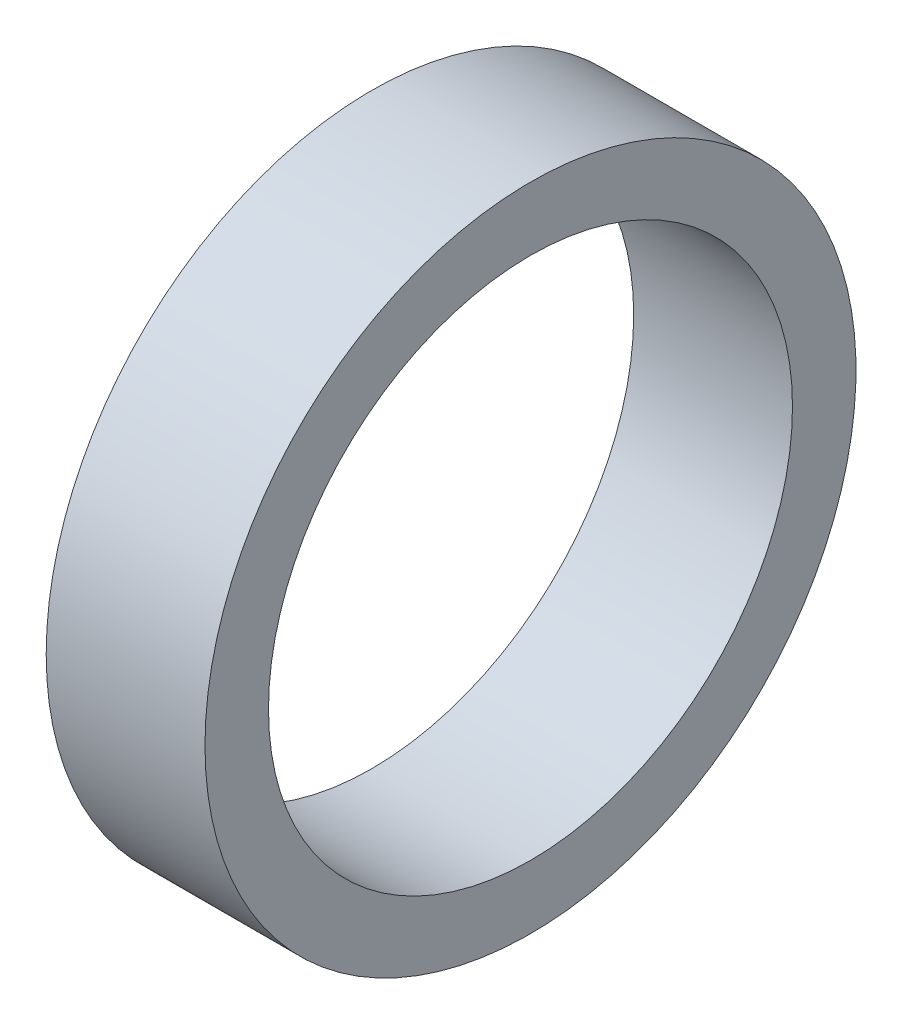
from build123d import *

# Parameters (mm, degrees)
ESQUISSE1_W = 10
ESQUISSE1_H = 4


with BuildPart() as part:
    # Esquisse1 → R_volution1 (revolve)
    with BuildSketch(Plane.XY, mode=Mode.PRIVATE) as r_volution1_sk:
        with Locations((0, 18.5)):
            Rectangle(ESQUISSE1_W, ESQUISSE1_H)
    revolve(r_volution1_sk.sketch.rotate(Axis((-14.903974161, 0, 0), (1, 0, 0)), 90), axis=Axis((-14.903974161, 0, 0), (1, 0, 0)))


solid = part.part
